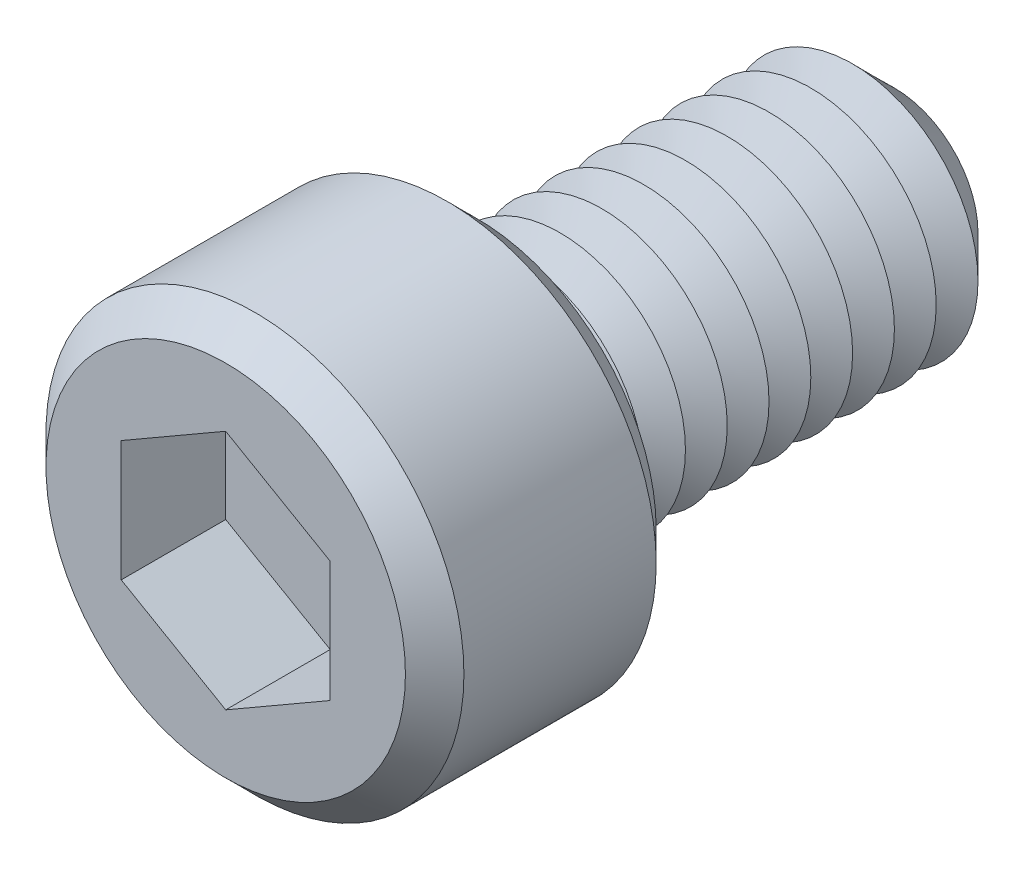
ISO-10303-21;
HEADER;
FILE_DESCRIPTION(('STEP AP214'),'2;1');
FILE_NAME('part.step','',(''),(''),'','','');
FILE_SCHEMA(('AUTOMOTIVE_DESIGN { 1 0 10303 214 1 1 1 1 }'));
ENDSEC;
DATA;
#1=APPLICATION_CONTEXT('core data for automotive mechanical design processes');
#2=APPLICATION_PROTOCOL_DEFINITION('international standard','automotive_design',2000,#1);
#3=PRODUCT_CONTEXT('',#1,'mechanical');
#4=PRODUCT('Part','Part','',(#3));
#5=PRODUCT_RELATED_PRODUCT_CATEGORY('part','',(#4));
#6=PRODUCT_DEFINITION_FORMATION('','',#4);
#7=PRODUCT_DEFINITION_CONTEXT('part definition',#1,'design');
#8=PRODUCT_DEFINITION('design','',#6,#7);
#9=PRODUCT_DEFINITION_SHAPE('','',#8);
#10=(LENGTH_UNIT() NAMED_UNIT(*) SI_UNIT(.MILLI.,.METRE.));
#11=(NAMED_UNIT(*) PLANE_ANGLE_UNIT() SI_UNIT($,.RADIAN.));
#12=(NAMED_UNIT(*) SI_UNIT($,.STERADIAN.) SOLID_ANGLE_UNIT());
#13=UNCERTAINTY_MEASURE_WITH_UNIT(LENGTH_MEASURE(1.E-05),#10,'distance_accuracy_value','');
#14=(GEOMETRIC_REPRESENTATION_CONTEXT(3) GLOBAL_UNCERTAINTY_ASSIGNED_CONTEXT((#13)) GLOBAL_UNIT_ASSIGNED_CONTEXT((#10,
#11,#12)) REPRESENTATION_CONTEXT('',''));
#15=CARTESIAN_POINT('',(0.,0.,0.));
#16=DIRECTION('',(0.,0.,1.));
#17=DIRECTION('',(1.,0.,0.));
#18=AXIS2_PLACEMENT_3D('',#15,#16,#17);
#19=CARTESIAN_POINT('',(0.,0.,6.));
#20=DIRECTION('',(0.,0.,-1.));
#21=DIRECTION('',(-1.,0.,0.));
#22=AXIS2_PLACEMENT_3D('',#19,#20,#21);
#23=CYLINDRICAL_SURFACE('',#22,5.);
#24=CARTESIAN_POINT('',(0.,0.,0.7));
#25=DIRECTION('',(0.,0.,1.));
#26=DIRECTION('',(1.,0.,0.));
#27=AXIS2_PLACEMENT_3D('',#24,#25,#26);
#28=CIRCLE('',#27,5.);
#29=CARTESIAN_POINT('',(5.,0.,0.7));
#30=VERTEX_POINT('',#29);
#31=EDGE_CURVE('E248',#30,#30,#28,.T.);
#32=ORIENTED_EDGE('',*,*,#31,.T.);
#33=EDGE_LOOP('',(#32));
#34=FACE_BOUND('',#33,.T.);
#35=CARTESIAN_POINT('',(0.,0.,5.3));
#36=DIRECTION('',(0.,0.,1.));
#37=DIRECTION('',(1.,0.,0.));
#38=AXIS2_PLACEMENT_3D('',#35,#36,#37);
#39=CIRCLE('',#38,5.);
#40=CARTESIAN_POINT('',(5.,0.,5.3));
#41=VERTEX_POINT('',#40);
#42=EDGE_CURVE('E244',#41,#41,#39,.F.);
#43=ORIENTED_EDGE('',*,*,#42,.T.);
#44=EDGE_LOOP('',(#43));
#45=FACE_BOUND('',#44,.T.);
#46=ADVANCED_FACE('F39',(#34,#45),#23,.T.);
#47=CARTESIAN_POINT('',(0.,0.,6.));
#48=DIRECTION('',(0.,0.,1.));
#49=DIRECTION('',(1.,0.,0.));
#50=AXIS2_PLACEMENT_3D('',#47,#48,#49);
#51=PLANE('',#50);
#52=CARTESIAN_POINT('',(0.,0.,6.));
#53=DIRECTION('',(0.,0.,1.));
#54=DIRECTION('',(1.,0.,0.));
#55=AXIS2_PLACEMENT_3D('',#52,#53,#54);
#56=CIRCLE('',#55,4.3);
#57=CARTESIAN_POINT('',(4.3,0.,6.));
#58=VERTEX_POINT('',#57);
#59=EDGE_CURVE('E11',#58,#58,#56,.T.);
#60=ORIENTED_EDGE('',*,*,#59,.T.);
#61=EDGE_LOOP('',(#60));
#62=FACE_BOUND('',#61,.T.);
#63=DIRECTION('',(-0.866025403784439,0.5,0.));
#64=VECTOR('',#63,1.);
#65=CARTESIAN_POINT('',(2.5,1.44337567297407,6.));
#66=LINE('',#65,#64);
#67=CARTESIAN_POINT('',(2.5,1.44337567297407,6.));
#68=VERTEX_POINT('',#67);
#69=CARTESIAN_POINT('',(0.,2.88675134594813,6.));
#70=VERTEX_POINT('',#69);
#71=EDGE_CURVE('E55',#68,#70,#66,.T.);
#72=ORIENTED_EDGE('',*,*,#71,.F.);
#73=DIRECTION('',(0.,1.,0.));
#74=VECTOR('',#73,1.);
#75=CARTESIAN_POINT('',(2.5,-1.44337567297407,6.));
#76=LINE('',#75,#74);
#77=CARTESIAN_POINT('',(2.5,-1.44337567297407,6.));
#78=VERTEX_POINT('',#77);
#79=EDGE_CURVE('E151',#78,#68,#76,.T.);
#80=ORIENTED_EDGE('',*,*,#79,.F.);
#81=DIRECTION('',(0.866025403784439,0.5,0.));
#82=VECTOR('',#81,1.);
#83=CARTESIAN_POINT('',(0.,-2.88675134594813,6.));
#84=LINE('',#83,#82);
#85=CARTESIAN_POINT('',(0.,-2.88675134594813,6.));
#86=VERTEX_POINT('',#85);
#87=EDGE_CURVE('E148',#86,#78,#84,.T.);
#88=ORIENTED_EDGE('',*,*,#87,.F.);
#89=DIRECTION('',(0.866025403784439,-0.5,0.));
#90=VECTOR('',#89,1.);
#91=CARTESIAN_POINT('',(-2.5,-1.44337567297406,6.));
#92=LINE('',#91,#90);
#93=CARTESIAN_POINT('',(-2.5,-1.44337567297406,6.));
#94=VERTEX_POINT('',#93);
#95=EDGE_CURVE('E103',#94,#86,#92,.T.);
#96=ORIENTED_EDGE('',*,*,#95,.F.);
#97=DIRECTION('',(0.,-1.,0.));
#98=VECTOR('',#97,1.);
#99=CARTESIAN_POINT('',(-2.5,1.44337567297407,6.));
#100=LINE('',#99,#98);
#101=CARTESIAN_POINT('',(-2.5,1.44337567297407,6.));
#102=VERTEX_POINT('',#101);
#103=EDGE_CURVE('E142',#102,#94,#100,.T.);
#104=ORIENTED_EDGE('',*,*,#103,.F.);
#105=DIRECTION('',(-0.866025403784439,-0.5,0.));
#106=VECTOR('',#105,1.);
#107=CARTESIAN_POINT('',(0.,2.88675134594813,6.));
#108=LINE('',#107,#106);
#109=EDGE_CURVE('E137',#70,#102,#108,.T.);
#110=ORIENTED_EDGE('',*,*,#109,.F.);
#111=EDGE_LOOP('',(#72,#80,#88,#96,#104,#110));
#112=FACE_BOUND('',#111,.T.);
#113=ADVANCED_FACE('F267',(#62,#112),#51,.T.);
#114=CARTESIAN_POINT('',(0.,0.,0.));
#115=DIRECTION('',(0.,0.,1.));
#116=DIRECTION('',(1.,0.,0.));
#117=AXIS2_PLACEMENT_3D('',#114,#115,#116);
#118=PLANE('',#117);
#119=CARTESIAN_POINT('',(0.,0.,0.));
#120=DIRECTION('',(0.,0.,1.));
#121=DIRECTION('',(1.,0.,0.));
#122=AXIS2_PLACEMENT_3D('',#119,#120,#121);
#123=CIRCLE('',#122,4.3);
#124=CARTESIAN_POINT('',(4.3,0.,0.));
#125=VERTEX_POINT('',#124);
#126=EDGE_CURVE('E48',#125,#125,#123,.F.);
#127=ORIENTED_EDGE('',*,*,#126,.T.);
#128=EDGE_LOOP('',(#127));
#129=FACE_BOUND('',#128,.T.);
#130=CARTESIAN_POINT('',(0.,0.,0.));
#131=DIRECTION('',(0.,0.,1.));
#132=DIRECTION('',(1.,0.,0.));
#133=AXIS2_PLACEMENT_3D('',#130,#131,#132);
#134=CIRCLE('',#133,3.);
#135=CARTESIAN_POINT('',(3.,0.,0.));
#136=VERTEX_POINT('',#135);
#137=EDGE_CURVE('E236',#136,#136,#134,.T.);
#138=ORIENTED_EDGE('',*,*,#137,.T.);
#139=EDGE_LOOP('',(#138));
#140=FACE_BOUND('',#139,.T.);
#141=ADVANCED_FACE('F256',(#129,#140),#118,.F.);
#142=CARTESIAN_POINT('',(0.,0.,0.));
#143=DIRECTION('',(0.,0.,1.));
#144=DIRECTION('',(1.,0.,0.));
#145=AXIS2_PLACEMENT_3D('',#142,#143,#144);
#146=CONICAL_SURFACE('',#145,3.,1.0471975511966);
#147=CARTESIAN_POINT('',(0.,0.,-0.5));
#148=DIRECTION('',(0.,0.,1.));
#149=DIRECTION('',(1.,0.,0.));
#150=AXIS2_PLACEMENT_3D('',#147,#148,#149);
#151=CIRCLE('',#150,2.13397459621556);
#152=CARTESIAN_POINT('',(2.13397459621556,0.,-0.5));
#153=VERTEX_POINT('',#152);
#154=EDGE_CURVE('E232',#153,#153,#151,.T.);
#155=ORIENTED_EDGE('',*,*,#154,.T.);
#156=EDGE_LOOP('',(#155));
#157=FACE_BOUND('',#156,.T.);
#158=ORIENTED_EDGE('',*,*,#137,.F.);
#159=EDGE_LOOP('',(#158));
#160=FACE_BOUND('',#159,.T.);
#161=ADVANCED_FACE('F388',(#157,#160),#146,.T.);
#162=CARTESIAN_POINT('',(0.,0.,-0.5));
#163=DIRECTION('',(0.,0.,-1.));
#164=DIRECTION('',(-1.,0.,0.));
#165=AXIS2_PLACEMENT_3D('',#162,#163,#164);
#166=CONICAL_SURFACE('',#165,2.13397459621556,1.0471975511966);
#167=CARTESIAN_POINT('',(0.,0.,-1.));
#168=DIRECTION('',(0.,0.,1.));
#169=DIRECTION('',(1.,0.,0.));
#170=AXIS2_PLACEMENT_3D('',#167,#168,#169);
#171=CIRCLE('',#170,3.);
#172=CARTESIAN_POINT('',(3.,0.,-1.));
#173=VERTEX_POINT('',#172);
#174=EDGE_CURVE('E228',#173,#173,#171,.T.);
#175=ORIENTED_EDGE('',*,*,#174,.T.);
#176=EDGE_LOOP('',(#175));
#177=FACE_BOUND('',#176,.T.);
#178=ORIENTED_EDGE('',*,*,#154,.F.);
#179=EDGE_LOOP('',(#178));
#180=FACE_BOUND('',#179,.T.);
#181=ADVANCED_FACE('F384',(#177,#180),#166,.T.);
#182=CARTESIAN_POINT('',(0.,0.,-1.));
#183=DIRECTION('',(0.,0.,1.));
#184=DIRECTION('',(1.,0.,0.));
#185=AXIS2_PLACEMENT_3D('',#182,#183,#184);
#186=CONICAL_SURFACE('',#185,3.,1.0471975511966);
#187=CARTESIAN_POINT('',(0.,0.,-1.5));
#188=DIRECTION('',(0.,0.,1.));
#189=DIRECTION('',(1.,0.,0.));
#190=AXIS2_PLACEMENT_3D('',#187,#188,#189);
#191=CIRCLE('',#190,2.13397459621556);
#192=CARTESIAN_POINT('',(2.13397459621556,0.,-1.5));
#193=VERTEX_POINT('',#192);
#194=EDGE_CURVE('E224',#193,#193,#191,.T.);
#195=ORIENTED_EDGE('',*,*,#194,.T.);
#196=EDGE_LOOP('',(#195));
#197=FACE_BOUND('',#196,.T.);
#198=ORIENTED_EDGE('',*,*,#174,.F.);
#199=EDGE_LOOP('',(#198));
#200=FACE_BOUND('',#199,.T.);
#201=ADVANCED_FACE('F380',(#197,#200),#186,.T.);
#202=CARTESIAN_POINT('',(0.,0.,-1.5));
#203=DIRECTION('',(0.,0.,-1.));
#204=DIRECTION('',(-1.,0.,0.));
#205=AXIS2_PLACEMENT_3D('',#202,#203,#204);
#206=CONICAL_SURFACE('',#205,2.13397459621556,1.0471975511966);
#207=CARTESIAN_POINT('',(0.,0.,-2.));
#208=DIRECTION('',(0.,0.,1.));
#209=DIRECTION('',(1.,0.,0.));
#210=AXIS2_PLACEMENT_3D('',#207,#208,#209);
#211=CIRCLE('',#210,3.);
#212=CARTESIAN_POINT('',(3.,0.,-2.));
#213=VERTEX_POINT('',#212);
#214=EDGE_CURVE('E220',#213,#213,#211,.T.);
#215=ORIENTED_EDGE('',*,*,#214,.T.);
#216=EDGE_LOOP('',(#215));
#217=FACE_BOUND('',#216,.T.);
#218=ORIENTED_EDGE('',*,*,#194,.F.);
#219=EDGE_LOOP('',(#218));
#220=FACE_BOUND('',#219,.T.);
#221=ADVANCED_FACE('F376',(#217,#220),#206,.T.);
#222=CARTESIAN_POINT('',(0.,0.,-2.));
#223=DIRECTION('',(0.,0.,1.));
#224=DIRECTION('',(1.,0.,0.));
#225=AXIS2_PLACEMENT_3D('',#222,#223,#224);
#226=CONICAL_SURFACE('',#225,3.,1.0471975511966);
#227=CARTESIAN_POINT('',(0.,0.,-2.5));
#228=DIRECTION('',(0.,0.,1.));
#229=DIRECTION('',(1.,0.,0.));
#230=AXIS2_PLACEMENT_3D('',#227,#228,#229);
#231=CIRCLE('',#230,2.13397459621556);
#232=CARTESIAN_POINT('',(2.13397459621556,0.,-2.5));
#233=VERTEX_POINT('',#232);
#234=EDGE_CURVE('E216',#233,#233,#231,.T.);
#235=ORIENTED_EDGE('',*,*,#234,.T.);
#236=EDGE_LOOP('',(#235));
#237=FACE_BOUND('',#236,.T.);
#238=ORIENTED_EDGE('',*,*,#214,.F.);
#239=EDGE_LOOP('',(#238));
#240=FACE_BOUND('',#239,.T.);
#241=ADVANCED_FACE('F372',(#237,#240),#226,.T.);
#242=CARTESIAN_POINT('',(0.,0.,-2.5));
#243=DIRECTION('',(0.,0.,-1.));
#244=DIRECTION('',(-1.,0.,0.));
#245=AXIS2_PLACEMENT_3D('',#242,#243,#244);
#246=CONICAL_SURFACE('',#245,2.13397459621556,1.0471975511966);
#247=CARTESIAN_POINT('',(0.,0.,-3.));
#248=DIRECTION('',(0.,0.,1.));
#249=DIRECTION('',(1.,0.,0.));
#250=AXIS2_PLACEMENT_3D('',#247,#248,#249);
#251=CIRCLE('',#250,3.);
#252=CARTESIAN_POINT('',(3.,0.,-3.));
#253=VERTEX_POINT('',#252);
#254=EDGE_CURVE('E212',#253,#253,#251,.T.);
#255=ORIENTED_EDGE('',*,*,#254,.T.);
#256=EDGE_LOOP('',(#255));
#257=FACE_BOUND('',#256,.T.);
#258=ORIENTED_EDGE('',*,*,#234,.F.);
#259=EDGE_LOOP('',(#258));
#260=FACE_BOUND('',#259,.T.);
#261=ADVANCED_FACE('F368',(#257,#260),#246,.T.);
#262=CARTESIAN_POINT('',(0.,0.,-3.));
#263=DIRECTION('',(0.,0.,1.));
#264=DIRECTION('',(1.,0.,0.));
#265=AXIS2_PLACEMENT_3D('',#262,#263,#264);
#266=CONICAL_SURFACE('',#265,3.,1.0471975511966);
#267=CARTESIAN_POINT('',(0.,0.,-3.5));
#268=DIRECTION('',(0.,0.,1.));
#269=DIRECTION('',(1.,0.,0.));
#270=AXIS2_PLACEMENT_3D('',#267,#268,#269);
#271=CIRCLE('',#270,2.13397459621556);
#272=CARTESIAN_POINT('',(2.13397459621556,0.,-3.5));
#273=VERTEX_POINT('',#272);
#274=EDGE_CURVE('E208',#273,#273,#271,.T.);
#275=ORIENTED_EDGE('',*,*,#274,.T.);
#276=EDGE_LOOP('',(#275));
#277=FACE_BOUND('',#276,.T.);
#278=ORIENTED_EDGE('',*,*,#254,.F.);
#279=EDGE_LOOP('',(#278));
#280=FACE_BOUND('',#279,.T.);
#281=ADVANCED_FACE('F364',(#277,#280),#266,.T.);
#282=CARTESIAN_POINT('',(0.,0.,-3.5));
#283=DIRECTION('',(0.,0.,-1.));
#284=DIRECTION('',(-1.,0.,0.));
#285=AXIS2_PLACEMENT_3D('',#282,#283,#284);
#286=CONICAL_SURFACE('',#285,2.13397459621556,1.0471975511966);
#287=CARTESIAN_POINT('',(0.,0.,-4.));
#288=DIRECTION('',(0.,0.,1.));
#289=DIRECTION('',(1.,0.,0.));
#290=AXIS2_PLACEMENT_3D('',#287,#288,#289);
#291=CIRCLE('',#290,3.);
#292=CARTESIAN_POINT('',(3.,0.,-4.));
#293=VERTEX_POINT('',#292);
#294=EDGE_CURVE('E204',#293,#293,#291,.T.);
#295=ORIENTED_EDGE('',*,*,#294,.T.);
#296=EDGE_LOOP('',(#295));
#297=FACE_BOUND('',#296,.T.);
#298=ORIENTED_EDGE('',*,*,#274,.F.);
#299=EDGE_LOOP('',(#298));
#300=FACE_BOUND('',#299,.T.);
#301=ADVANCED_FACE('F360',(#297,#300),#286,.T.);
#302=CARTESIAN_POINT('',(0.,0.,-4.));
#303=DIRECTION('',(0.,0.,1.));
#304=DIRECTION('',(1.,0.,0.));
#305=AXIS2_PLACEMENT_3D('',#302,#303,#304);
#306=CONICAL_SURFACE('',#305,3.,1.0471975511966);
#307=CARTESIAN_POINT('',(0.,0.,-4.5));
#308=DIRECTION('',(0.,0.,1.));
#309=DIRECTION('',(1.,0.,0.));
#310=AXIS2_PLACEMENT_3D('',#307,#308,#309);
#311=CIRCLE('',#310,2.13397459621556);
#312=CARTESIAN_POINT('',(2.13397459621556,0.,-4.5));
#313=VERTEX_POINT('',#312);
#314=EDGE_CURVE('E201',#313,#313,#311,.T.);
#315=ORIENTED_EDGE('',*,*,#314,.T.);
#316=EDGE_LOOP('',(#315));
#317=FACE_BOUND('',#316,.T.);
#318=ORIENTED_EDGE('',*,*,#294,.F.);
#319=EDGE_LOOP('',(#318));
#320=FACE_BOUND('',#319,.T.);
#321=ADVANCED_FACE('F356',(#317,#320),#306,.T.);
#322=CARTESIAN_POINT('',(0.,0.,-4.5));
#323=DIRECTION('',(0.,0.,-1.));
#324=DIRECTION('',(-1.,0.,0.));
#325=AXIS2_PLACEMENT_3D('',#322,#323,#324);
#326=CONICAL_SURFACE('',#325,2.13397459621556,1.0471975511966);
#327=CARTESIAN_POINT('',(0.,0.,-5.));
#328=DIRECTION('',(0.,0.,1.));
#329=DIRECTION('',(1.,0.,0.));
#330=AXIS2_PLACEMENT_3D('',#327,#328,#329);
#331=CIRCLE('',#330,3.);
#332=CARTESIAN_POINT('',(3.,0.,-5.));
#333=VERTEX_POINT('',#332);
#334=EDGE_CURVE('E197',#333,#333,#331,.T.);
#335=ORIENTED_EDGE('',*,*,#334,.T.);
#336=EDGE_LOOP('',(#335));
#337=FACE_BOUND('',#336,.T.);
#338=ORIENTED_EDGE('',*,*,#314,.F.);
#339=EDGE_LOOP('',(#338));
#340=FACE_BOUND('',#339,.T.);
#341=ADVANCED_FACE('F352',(#337,#340),#326,.T.);
#342=CARTESIAN_POINT('',(0.,0.,-5.));
#343=DIRECTION('',(0.,0.,1.));
#344=DIRECTION('',(1.,0.,0.));
#345=AXIS2_PLACEMENT_3D('',#342,#343,#344);
#346=CONICAL_SURFACE('',#345,3.,1.0471975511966);
#347=CARTESIAN_POINT('',(0.,0.,-5.5));
#348=DIRECTION('',(0.,0.,1.));
#349=DIRECTION('',(1.,0.,0.));
#350=AXIS2_PLACEMENT_3D('',#347,#348,#349);
#351=CIRCLE('',#350,2.13397459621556);
#352=CARTESIAN_POINT('',(2.13397459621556,0.,-5.5));
#353=VERTEX_POINT('',#352);
#354=EDGE_CURVE('E193',#353,#353,#351,.T.);
#355=ORIENTED_EDGE('',*,*,#354,.T.);
#356=EDGE_LOOP('',(#355));
#357=FACE_BOUND('',#356,.T.);
#358=ORIENTED_EDGE('',*,*,#334,.F.);
#359=EDGE_LOOP('',(#358));
#360=FACE_BOUND('',#359,.T.);
#361=ADVANCED_FACE('F348',(#357,#360),#346,.T.);
#362=CARTESIAN_POINT('',(0.,0.,-5.5));
#363=DIRECTION('',(0.,0.,-1.));
#364=DIRECTION('',(-1.,0.,0.));
#365=AXIS2_PLACEMENT_3D('',#362,#363,#364);
#366=CONICAL_SURFACE('',#365,2.13397459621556,1.0471975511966);
#367=CARTESIAN_POINT('',(0.,0.,-6.));
#368=DIRECTION('',(0.,0.,1.));
#369=DIRECTION('',(1.,0.,0.));
#370=AXIS2_PLACEMENT_3D('',#367,#368,#369);
#371=CIRCLE('',#370,3.);
#372=CARTESIAN_POINT('',(3.,0.,-6.));
#373=VERTEX_POINT('',#372);
#374=EDGE_CURVE('E189',#373,#373,#371,.T.);
#375=ORIENTED_EDGE('',*,*,#374,.T.);
#376=EDGE_LOOP('',(#375));
#377=FACE_BOUND('',#376,.T.);
#378=ORIENTED_EDGE('',*,*,#354,.F.);
#379=EDGE_LOOP('',(#378));
#380=FACE_BOUND('',#379,.T.);
#381=ADVANCED_FACE('F344',(#377,#380),#366,.T.);
#382=CARTESIAN_POINT('',(0.,0.,-6.));
#383=DIRECTION('',(0.,0.,1.));
#384=DIRECTION('',(1.,0.,0.));
#385=AXIS2_PLACEMENT_3D('',#382,#383,#384);
#386=CONICAL_SURFACE('',#385,3.,1.0471975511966);
#387=CARTESIAN_POINT('',(0.,0.,-6.5));
#388=DIRECTION('',(0.,0.,1.));
#389=DIRECTION('',(1.,0.,0.));
#390=AXIS2_PLACEMENT_3D('',#387,#388,#389);
#391=CIRCLE('',#390,2.13397459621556);
#392=CARTESIAN_POINT('',(2.13397459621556,0.,-6.5));
#393=VERTEX_POINT('',#392);
#394=EDGE_CURVE('E185',#393,#393,#391,.T.);
#395=ORIENTED_EDGE('',*,*,#394,.T.);
#396=EDGE_LOOP('',(#395));
#397=FACE_BOUND('',#396,.T.);
#398=ORIENTED_EDGE('',*,*,#374,.F.);
#399=EDGE_LOOP('',(#398));
#400=FACE_BOUND('',#399,.T.);
#401=ADVANCED_FACE('F340',(#397,#400),#386,.T.);
#402=CARTESIAN_POINT('',(0.,0.,-6.5));
#403=DIRECTION('',(0.,0.,-1.));
#404=DIRECTION('',(-1.,0.,0.));
#405=AXIS2_PLACEMENT_3D('',#402,#403,#404);
#406=CONICAL_SURFACE('',#405,2.13397459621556,1.0471975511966);
#407=CARTESIAN_POINT('',(0.,0.,-7.));
#408=DIRECTION('',(0.,0.,1.));
#409=DIRECTION('',(1.,0.,0.));
#410=AXIS2_PLACEMENT_3D('',#407,#408,#409);
#411=CIRCLE('',#410,3.);
#412=CARTESIAN_POINT('',(3.,0.,-7.));
#413=VERTEX_POINT('',#412);
#414=EDGE_CURVE('E181',#413,#413,#411,.T.);
#415=ORIENTED_EDGE('',*,*,#414,.T.);
#416=EDGE_LOOP('',(#415));
#417=FACE_BOUND('',#416,.T.);
#418=ORIENTED_EDGE('',*,*,#394,.F.);
#419=EDGE_LOOP('',(#418));
#420=FACE_BOUND('',#419,.T.);
#421=ADVANCED_FACE('F336',(#417,#420),#406,.T.);
#422=CARTESIAN_POINT('',(0.,0.,-7.));
#423=DIRECTION('',(0.,0.,1.));
#424=DIRECTION('',(1.,0.,0.));
#425=AXIS2_PLACEMENT_3D('',#422,#423,#424);
#426=CONICAL_SURFACE('',#425,3.,1.0471975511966);
#427=CARTESIAN_POINT('',(0.,0.,-7.5));
#428=DIRECTION('',(0.,0.,1.));
#429=DIRECTION('',(1.,0.,0.));
#430=AXIS2_PLACEMENT_3D('',#427,#428,#429);
#431=CIRCLE('',#430,2.13397459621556);
#432=CARTESIAN_POINT('',(2.13397459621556,0.,-7.5));
#433=VERTEX_POINT('',#432);
#434=EDGE_CURVE('E177',#433,#433,#431,.T.);
#435=ORIENTED_EDGE('',*,*,#434,.T.);
#436=EDGE_LOOP('',(#435));
#437=FACE_BOUND('',#436,.T.);
#438=ORIENTED_EDGE('',*,*,#414,.F.);
#439=EDGE_LOOP('',(#438));
#440=FACE_BOUND('',#439,.T.);
#441=ADVANCED_FACE('F332',(#437,#440),#426,.T.);
#442=CARTESIAN_POINT('',(0.,0.,-7.5));
#443=DIRECTION('',(0.,0.,-1.));
#444=DIRECTION('',(-1.,0.,0.));
#445=AXIS2_PLACEMENT_3D('',#442,#443,#444);
#446=CONICAL_SURFACE('',#445,2.13397459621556,1.0471975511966);
#447=CARTESIAN_POINT('',(0.,0.,-8.));
#448=DIRECTION('',(0.,0.,1.));
#449=DIRECTION('',(1.,0.,0.));
#450=AXIS2_PLACEMENT_3D('',#447,#448,#449);
#451=CIRCLE('',#450,3.);
#452=CARTESIAN_POINT('',(3.,0.,-8.));
#453=VERTEX_POINT('',#452);
#454=EDGE_CURVE('E173',#453,#453,#451,.T.);
#455=ORIENTED_EDGE('',*,*,#454,.T.);
#456=EDGE_LOOP('',(#455));
#457=FACE_BOUND('',#456,.T.);
#458=ORIENTED_EDGE('',*,*,#434,.F.);
#459=EDGE_LOOP('',(#458));
#460=FACE_BOUND('',#459,.T.);
#461=ADVANCED_FACE('F328',(#457,#460),#446,.T.);
#462=CARTESIAN_POINT('',(0.,0.,-8.));
#463=DIRECTION('',(0.,0.,1.));
#464=DIRECTION('',(1.,0.,0.));
#465=AXIS2_PLACEMENT_3D('',#462,#463,#464);
#466=CONICAL_SURFACE('',#465,3.,1.0471975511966);
#467=CARTESIAN_POINT('',(0.,0.,-8.5));
#468=DIRECTION('',(0.,0.,1.));
#469=DIRECTION('',(1.,0.,0.));
#470=AXIS2_PLACEMENT_3D('',#467,#468,#469);
#471=CIRCLE('',#470,2.13397459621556);
#472=CARTESIAN_POINT('',(2.13397459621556,0.,-8.5));
#473=VERTEX_POINT('',#472);
#474=EDGE_CURVE('E169',#473,#473,#471,.T.);
#475=ORIENTED_EDGE('',*,*,#474,.T.);
#476=EDGE_LOOP('',(#475));
#477=FACE_BOUND('',#476,.T.);
#478=ORIENTED_EDGE('',*,*,#454,.F.);
#479=EDGE_LOOP('',(#478));
#480=FACE_BOUND('',#479,.T.);
#481=ADVANCED_FACE('F324',(#477,#480),#466,.T.);
#482=CARTESIAN_POINT('',(0.,0.,-8.5));
#483=DIRECTION('',(0.,0.,-1.));
#484=DIRECTION('',(-1.,0.,0.));
#485=AXIS2_PLACEMENT_3D('',#482,#483,#484);
#486=CONICAL_SURFACE('',#485,2.13397459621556,1.0471975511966);
#487=CARTESIAN_POINT('',(0.,0.,-9.));
#488=DIRECTION('',(0.,0.,1.));
#489=DIRECTION('',(1.,0.,0.));
#490=AXIS2_PLACEMENT_3D('',#487,#488,#489);
#491=CIRCLE('',#490,3.);
#492=CARTESIAN_POINT('',(3.,0.,-9.));
#493=VERTEX_POINT('',#492);
#494=EDGE_CURVE('E157',#493,#493,#491,.T.);
#495=ORIENTED_EDGE('',*,*,#494,.T.);
#496=EDGE_LOOP('',(#495));
#497=FACE_BOUND('',#496,.T.);
#498=ORIENTED_EDGE('',*,*,#474,.F.);
#499=EDGE_LOOP('',(#498));
#500=FACE_BOUND('',#499,.T.);
#501=ADVANCED_FACE('F320',(#497,#500),#486,.T.);
#502=CARTESIAN_POINT('',(0.,0.,-10.));
#503=DIRECTION('',(0.,0.,-1.));
#504=DIRECTION('',(-1.,0.,0.));
#505=AXIS2_PLACEMENT_3D('',#502,#503,#504);
#506=PLANE('',#505);
#507=CARTESIAN_POINT('',(0.,0.,-10.));
#508=DIRECTION('',(0.,0.,-1.));
#509=DIRECTION('',(-1.,0.,0.));
#510=AXIS2_PLACEMENT_3D('',#507,#508,#509);
#511=CIRCLE('',#510,0.8);
#512=CARTESIAN_POINT('',(-0.8,0.,-10.));
#513=VERTEX_POINT('',#512);
#514=EDGE_CURVE('E138',#513,#513,#511,.F.);
#515=ORIENTED_EDGE('',*,*,#514,.T.);
#516=EDGE_LOOP('',(#515));
#517=FACE_BOUND('',#516,.T.);
#518=CARTESIAN_POINT('',(0.,0.,-10.));
#519=DIRECTION('',(0.,0.,-1.));
#520=DIRECTION('',(-1.,0.,0.));
#521=AXIS2_PLACEMENT_3D('',#518,#519,#520);
#522=CIRCLE('',#521,2.);
#523=CARTESIAN_POINT('',(-2.,0.,-10.));
#524=VERTEX_POINT('',#523);
#525=EDGE_CURVE('E240',#524,#524,#522,.T.);
#526=ORIENTED_EDGE('',*,*,#525,.T.);
#527=EDGE_LOOP('',(#526));
#528=FACE_BOUND('',#527,.T.);
#529=ADVANCED_FACE('F323',(#517,#528),#506,.T.);
#530=CARTESIAN_POINT('',(0.,0.,-10.));
#531=DIRECTION('',(0.,0.,1.));
#532=DIRECTION('',(1.,0.,0.));
#533=AXIS2_PLACEMENT_3D('',#530,#531,#532);
#534=CONICAL_SURFACE('',#533,2.,0.785398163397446);
#535=ORIENTED_EDGE('',*,*,#494,.F.);
#536=EDGE_LOOP('',(#535));
#537=FACE_BOUND('',#536,.T.);
#538=ORIENTED_EDGE('',*,*,#525,.F.);
#539=EDGE_LOOP('',(#538));
#540=FACE_BOUND('',#539,.T.);
#541=ADVANCED_FACE('F319',(#537,#540),#534,.T.);
#542=CARTESIAN_POINT('',(2.5,1.44337567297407,3.5));
#543=DIRECTION('',(0.5,0.866025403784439,0.));
#544=DIRECTION('',(-0.866025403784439,0.5,0.));
#545=AXIS2_PLACEMENT_3D('',#542,#543,#544);
#546=PLANE('',#545);
#547=ORIENTED_EDGE('',*,*,#71,.T.);
#548=DIRECTION('',(0.,0.,1.));
#549=VECTOR('',#548,1.);
#550=CARTESIAN_POINT('',(0.,2.88675134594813,3.5));
#551=LINE('',#550,#549);
#552=CARTESIAN_POINT('',(0.,2.88675134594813,3.5));
#553=VERTEX_POINT('',#552);
#554=EDGE_CURVE('E85',#553,#70,#551,.T.);
#555=ORIENTED_EDGE('',*,*,#554,.F.);
#556=DIRECTION('',(-0.866025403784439,0.5,0.));
#557=VECTOR('',#556,1.);
#558=CARTESIAN_POINT('',(2.5,1.44337567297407,3.5));
#559=LINE('',#558,#557);
#560=CARTESIAN_POINT('',(2.5,1.44337567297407,3.5));
#561=VERTEX_POINT('',#560);
#562=EDGE_CURVE('E154',#561,#553,#559,.T.);
#563=ORIENTED_EDGE('',*,*,#562,.F.);
#564=DIRECTION('',(0.,0.,1.));
#565=VECTOR('',#564,1.);
#566=CARTESIAN_POINT('',(2.5,1.44337567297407,3.5));
#567=LINE('',#566,#565);
#568=EDGE_CURVE('E63',#561,#68,#567,.T.);
#569=ORIENTED_EDGE('',*,*,#568,.T.);
#570=EDGE_LOOP('',(#547,#555,#563,#569));
#571=FACE_BOUND('',#570,.T.);
#572=ADVANCED_FACE('F309',(#571),#546,.F.);
#573=CARTESIAN_POINT('',(2.5,-1.44337567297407,3.5));
#574=DIRECTION('',(1.,0.,0.));
#575=DIRECTION('',(0.,0.,-1.));
#576=AXIS2_PLACEMENT_3D('',#573,#574,#575);
#577=PLANE('',#576);
#578=ORIENTED_EDGE('',*,*,#79,.T.);
#579=ORIENTED_EDGE('',*,*,#568,.F.);
#580=DIRECTION('',(0.,1.,0.));
#581=VECTOR('',#580,1.);
#582=CARTESIAN_POINT('',(2.5,-1.44337567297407,3.5));
#583=LINE('',#582,#581);
#584=CARTESIAN_POINT('',(2.5,-1.44337567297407,3.5));
#585=VERTEX_POINT('',#584);
#586=EDGE_CURVE('E117',#585,#561,#583,.T.);
#587=ORIENTED_EDGE('',*,*,#586,.F.);
#588=DIRECTION('',(0.,0.,1.));
#589=VECTOR('',#588,1.);
#590=CARTESIAN_POINT('',(2.5,-1.44337567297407,3.5));
#591=LINE('',#590,#589);
#592=EDGE_CURVE('E108',#585,#78,#591,.T.);
#593=ORIENTED_EDGE('',*,*,#592,.T.);
#594=EDGE_LOOP('',(#578,#579,#587,#593));
#595=FACE_BOUND('',#594,.T.);
#596=ADVANCED_FACE('F306',(#595),#577,.F.);
#597=CARTESIAN_POINT('',(0.,-2.88675134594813,3.5));
#598=DIRECTION('',(0.5,-0.866025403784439,0.));
#599=DIRECTION('',(0.866025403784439,0.5,0.));
#600=AXIS2_PLACEMENT_3D('',#597,#598,#599);
#601=PLANE('',#600);
#602=ORIENTED_EDGE('',*,*,#87,.T.);
#603=ORIENTED_EDGE('',*,*,#592,.F.);
#604=DIRECTION('',(0.866025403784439,0.5,0.));
#605=VECTOR('',#604,1.);
#606=CARTESIAN_POINT('',(0.,-2.88675134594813,3.5));
#607=LINE('',#606,#605);
#608=CARTESIAN_POINT('',(0.,-2.88675134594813,3.5));
#609=VERTEX_POINT('',#608);
#610=EDGE_CURVE('E112',#609,#585,#607,.T.);
#611=ORIENTED_EDGE('',*,*,#610,.F.);
#612=DIRECTION('',(0.,0.,1.));
#613=VECTOR('',#612,1.);
#614=CARTESIAN_POINT('',(0.,-2.88675134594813,3.5));
#615=LINE('',#614,#613);
#616=EDGE_CURVE('E96',#609,#86,#615,.T.);
#617=ORIENTED_EDGE('',*,*,#616,.T.);
#618=EDGE_LOOP('',(#602,#603,#611,#617));
#619=FACE_BOUND('',#618,.T.);
#620=ADVANCED_FACE('F113',(#619),#601,.F.);
#621=CARTESIAN_POINT('',(-2.5,-1.44337567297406,3.5));
#622=DIRECTION('',(-0.5,-0.866025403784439,0.));
#623=DIRECTION('',(0.866025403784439,-0.5,0.));
#624=AXIS2_PLACEMENT_3D('',#621,#622,#623);
#625=PLANE('',#624);
#626=ORIENTED_EDGE('',*,*,#95,.T.);
#627=ORIENTED_EDGE('',*,*,#616,.F.);
#628=DIRECTION('',(0.866025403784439,-0.5,0.));
#629=VECTOR('',#628,1.);
#630=CARTESIAN_POINT('',(-2.5,-1.44337567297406,3.5));
#631=LINE('',#630,#629);
#632=CARTESIAN_POINT('',(-2.5,-1.44337567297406,3.5));
#633=VERTEX_POINT('',#632);
#634=EDGE_CURVE('E100',#633,#609,#631,.T.);
#635=ORIENTED_EDGE('',*,*,#634,.F.);
#636=DIRECTION('',(0.,0.,1.));
#637=VECTOR('',#636,1.);
#638=CARTESIAN_POINT('',(-2.5,-1.44337567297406,3.5));
#639=LINE('',#638,#637);
#640=EDGE_CURVE('E109',#633,#94,#639,.T.);
#641=ORIENTED_EDGE('',*,*,#640,.T.);
#642=EDGE_LOOP('',(#626,#627,#635,#641));
#643=FACE_BOUND('',#642,.T.);
#644=ADVANCED_FACE('F98',(#643),#625,.F.);
#645=CARTESIAN_POINT('',(-2.5,1.44337567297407,3.5));
#646=DIRECTION('',(-1.,0.,0.));
#647=DIRECTION('',(0.,0.,1.));
#648=AXIS2_PLACEMENT_3D('',#645,#646,#647);
#649=PLANE('',#648);
#650=ORIENTED_EDGE('',*,*,#103,.T.);
#651=ORIENTED_EDGE('',*,*,#640,.F.);
#652=DIRECTION('',(0.,-1.,0.));
#653=VECTOR('',#652,1.);
#654=CARTESIAN_POINT('',(-2.5,1.44337567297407,3.5));
#655=LINE('',#654,#653);
#656=CARTESIAN_POINT('',(-2.5,1.44337567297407,3.5));
#657=VERTEX_POINT('',#656);
#658=EDGE_CURVE('E123',#657,#633,#655,.T.);
#659=ORIENTED_EDGE('',*,*,#658,.F.);
#660=DIRECTION('',(0.,0.,1.));
#661=VECTOR('',#660,1.);
#662=CARTESIAN_POINT('',(-2.5,1.44337567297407,3.5));
#663=LINE('',#662,#661);
#664=EDGE_CURVE('E161',#657,#102,#663,.T.);
#665=ORIENTED_EDGE('',*,*,#664,.T.);
#666=EDGE_LOOP('',(#650,#651,#659,#665));
#667=FACE_BOUND('',#666,.T.);
#668=ADVANCED_FACE('F303',(#667),#649,.F.);
#669=CARTESIAN_POINT('',(0.,2.88675134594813,3.5));
#670=DIRECTION('',(-0.5,0.866025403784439,0.));
#671=DIRECTION('',(-0.866025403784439,-0.5,0.));
#672=AXIS2_PLACEMENT_3D('',#669,#670,#671);
#673=PLANE('',#672);
#674=ORIENTED_EDGE('',*,*,#109,.T.);
#675=ORIENTED_EDGE('',*,*,#664,.F.);
#676=DIRECTION('',(-0.866025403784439,-0.5,0.));
#677=VECTOR('',#676,1.);
#678=CARTESIAN_POINT('',(0.,2.88675134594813,3.5));
#679=LINE('',#678,#677);
#680=EDGE_CURVE('E129',#553,#657,#679,.T.);
#681=ORIENTED_EDGE('',*,*,#680,.F.);
#682=ORIENTED_EDGE('',*,*,#554,.T.);
#683=EDGE_LOOP('',(#674,#675,#681,#682));
#684=FACE_BOUND('',#683,.T.);
#685=ADVANCED_FACE('F282',(#684),#673,.F.);
#686=CARTESIAN_POINT('',(0.,0.,3.5));
#687=DIRECTION('',(0.,0.,1.));
#688=DIRECTION('',(1.,0.,0.));
#689=AXIS2_PLACEMENT_3D('',#686,#687,#688);
#690=PLANE('',#689);
#691=CARTESIAN_POINT('',(0.,0.,3.5));
#692=DIRECTION('',(0.,0.,1.));
#693=DIRECTION('',(1.,0.,0.));
#694=AXIS2_PLACEMENT_3D('',#691,#692,#693);
#695=CIRCLE('',#694,0.8);
#696=CARTESIAN_POINT('',(0.8,0.,3.5));
#697=VERTEX_POINT('',#696);
#698=EDGE_CURVE('E289',#697,#697,#695,.T.);
#699=ORIENTED_EDGE('',*,*,#698,.F.);
#700=EDGE_LOOP('',(#699));
#701=FACE_BOUND('',#700,.T.);
#702=ORIENTED_EDGE('',*,*,#562,.T.);
#703=ORIENTED_EDGE('',*,*,#680,.T.);
#704=ORIENTED_EDGE('',*,*,#658,.T.);
#705=ORIENTED_EDGE('',*,*,#634,.T.);
#706=ORIENTED_EDGE('',*,*,#610,.T.);
#707=ORIENTED_EDGE('',*,*,#586,.T.);
#708=EDGE_LOOP('',(#702,#703,#704,#705,#706,#707));
#709=FACE_BOUND('',#708,.T.);
#710=ADVANCED_FACE('F120',(#701,#709),#690,.T.);
#711=CARTESIAN_POINT('',(0.,0.,-12.262741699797));
#712=DIRECTION('',(0.,0.,1.));
#713=DIRECTION('',(1.,0.,0.));
#714=AXIS2_PLACEMENT_3D('',#711,#712,#713);
#715=CYLINDRICAL_SURFACE('',#714,0.8);
#716=ORIENTED_EDGE('',*,*,#698,.T.);
#717=EDGE_LOOP('',(#716));
#718=FACE_BOUND('',#717,.T.);
#719=ORIENTED_EDGE('',*,*,#514,.F.);
#720=EDGE_LOOP('',(#719));
#721=FACE_BOUND('',#720,.T.);
#722=ADVANCED_FACE('F262',(#718,#721),#715,.F.);
#723=CARTESIAN_POINT('',(0.,0.,0.7));
#724=DIRECTION('',(0.,0.,1.));
#725=DIRECTION('',(1.,0.,0.));
#726=AXIS2_PLACEMENT_3D('',#723,#724,#725);
#727=CONICAL_SURFACE('',#726,5.,0.785398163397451);
#728=ORIENTED_EDGE('',*,*,#126,.F.);
#729=EDGE_LOOP('',(#728));
#730=FACE_BOUND('',#729,.T.);
#731=ORIENTED_EDGE('',*,*,#31,.F.);
#732=EDGE_LOOP('',(#731));
#733=FACE_BOUND('',#732,.T.);
#734=ADVANCED_FACE('F259',(#730,#733),#727,.T.);
#735=CARTESIAN_POINT('',(0.,0.,6.));
#736=DIRECTION('',(0.,0.,-1.));
#737=DIRECTION('',(-1.,0.,0.));
#738=AXIS2_PLACEMENT_3D('',#735,#736,#737);
#739=CONICAL_SURFACE('',#738,4.3,0.785398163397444);
#740=ORIENTED_EDGE('',*,*,#42,.F.);
#741=EDGE_LOOP('',(#740));
#742=FACE_BOUND('',#741,.T.);
#743=ORIENTED_EDGE('',*,*,#59,.F.);
#744=EDGE_LOOP('',(#743));
#745=FACE_BOUND('',#744,.T.);
#746=ADVANCED_FACE('F41',(#742,#745),#739,.T.);
#747=CLOSED_SHELL('',(#46,#113,#141,#161,#181,#201,#221,#241,#261,#281,#301,#321,#341,#361,#381,
#401,#421,#441,#461,#481,#501,#529,#541,#572,#596,#620,#644,#668,#685,#710,#722,#734,#746));
#748=MANIFOLD_SOLID_BREP('B2',#747);
#749=ADVANCED_BREP_SHAPE_REPRESENTATION('',(#18,#748),#14);
#750=SHAPE_DEFINITION_REPRESENTATION(#9,#749);
ENDSEC;
END-ISO-10303-21;
